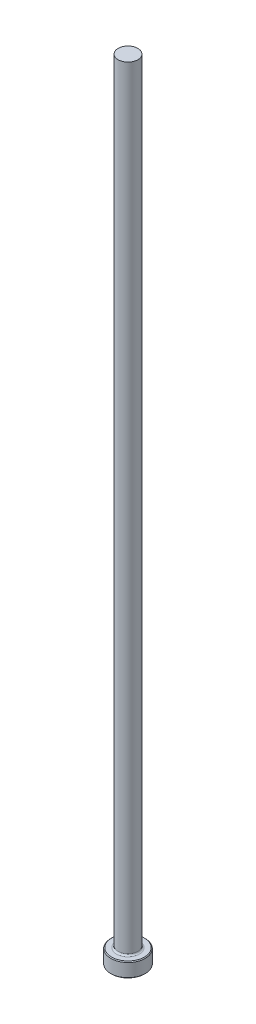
from build123d import *

# Parameters (mm, degrees)
CHAMFER1_SIZE = 0.254
FILLET1_R     = 0.508


with BuildPart() as part:
    # Sketch1 → Revolve1 (revolve)
    with BuildSketch(Plane.XY, mode=Mode.PRIVATE) as revolve1_sk:
        Polygon((0, 0), (-5.5499, 0), (-5.5499, 4.7498), (-3.175, 4.7498), (-3.175, 254), (0, 254), align=None)
    revolve(revolve1_sk.sketch.rotate(Axis((0, 259.958771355, 0), (0, -1, 0)), 270), axis=Axis((0, 259.958771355, 0), (0, -1, 0)))

    # Chamfer1
    chamfer1_edges = [part.edges().sort_by_distance(p)[0] for p in [
        (0, 4.7498, -5.5499),
        (0, 0, -5.5499),
    ]]
    chamfer(chamfer1_edges, length=CHAMFER1_SIZE)

    # Fillet1
    fillet1_edges = [part.edges().sort_by_distance(p)[0] for p in [
        (0, 4.7498, -3.175),
    ]]
    fillet(fillet1_edges, radius=FILLET1_R)


solid = part.part
